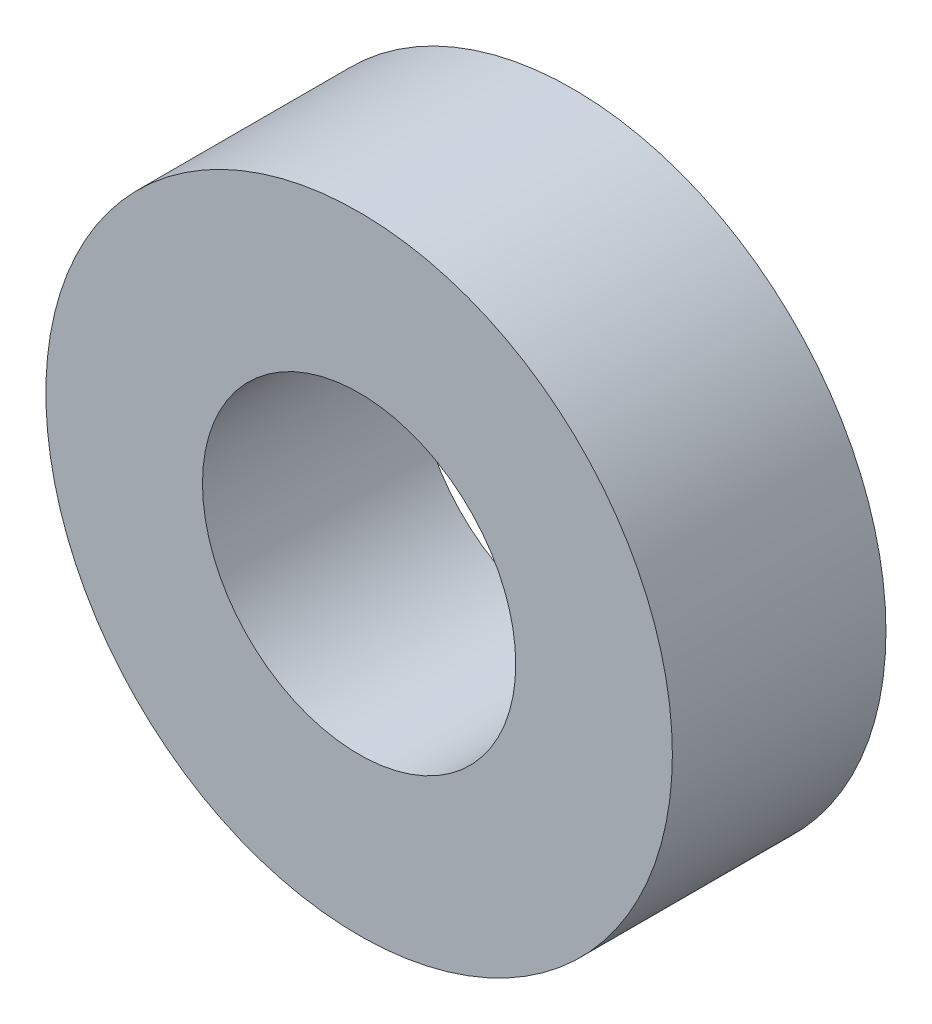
ISO-10303-21;
HEADER;
FILE_DESCRIPTION(('STEP AP214'),'2;1');
FILE_NAME('part.step','',(''),(''),'','','');
FILE_SCHEMA(('AUTOMOTIVE_DESIGN { 1 0 10303 214 1 1 1 1 }'));
ENDSEC;
DATA;
#1=APPLICATION_CONTEXT('core data for automotive mechanical design processes');
#2=APPLICATION_PROTOCOL_DEFINITION('international standard','automotive_design',2000,#1);
#3=PRODUCT_CONTEXT('',#1,'mechanical');
#4=PRODUCT('Part','Part','',(#3));
#5=PRODUCT_RELATED_PRODUCT_CATEGORY('part','',(#4));
#6=PRODUCT_DEFINITION_FORMATION('','',#4);
#7=PRODUCT_DEFINITION_CONTEXT('part definition',#1,'design');
#8=PRODUCT_DEFINITION('design','',#6,#7);
#9=PRODUCT_DEFINITION_SHAPE('','',#8);
#10=(LENGTH_UNIT() NAMED_UNIT(*) SI_UNIT(.MILLI.,.METRE.));
#11=(NAMED_UNIT(*) PLANE_ANGLE_UNIT() SI_UNIT($,.RADIAN.));
#12=(NAMED_UNIT(*) SI_UNIT($,.STERADIAN.) SOLID_ANGLE_UNIT());
#13=UNCERTAINTY_MEASURE_WITH_UNIT(LENGTH_MEASURE(1.E-05),#10,'distance_accuracy_value','');
#14=(GEOMETRIC_REPRESENTATION_CONTEXT(3) GLOBAL_UNCERTAINTY_ASSIGNED_CONTEXT((#13)) GLOBAL_UNIT_ASSIGNED_CONTEXT((#10,
#11,#12)) REPRESENTATION_CONTEXT('',''));
#15=CARTESIAN_POINT('',(0.,0.,0.));
#16=DIRECTION('',(0.,0.,1.));
#17=DIRECTION('',(1.,0.,0.));
#18=AXIS2_PLACEMENT_3D('',#15,#16,#17);
#19=CARTESIAN_POINT('',(0.,0.,95.25));
#20=DIRECTION('',(0.,0.,1.));
#21=DIRECTION('',(1.,0.,0.));
#22=AXIS2_PLACEMENT_3D('',#19,#20,#21);
#23=PLANE('',#22);
#24=CARTESIAN_POINT('',(0.,0.,95.25));
#25=DIRECTION('',(0.,0.,1.));
#26=DIRECTION('',(1.,0.,0.));
#27=AXIS2_PLACEMENT_3D('',#24,#25,#26);
#28=CIRCLE('',#27,139.7);
#29=CARTESIAN_POINT('',(139.7,0.,95.25));
#30=VERTEX_POINT('',#29);
#31=EDGE_CURVE('E10',#30,#30,#28,.T.);
#32=ORIENTED_EDGE('',*,*,#31,.T.);
#33=EDGE_LOOP('',(#32));
#34=FACE_BOUND('',#33,.T.);
#35=CARTESIAN_POINT('',(0.,0.,95.25));
#36=DIRECTION('',(0.,0.,1.));
#37=DIRECTION('',(1.,0.,0.));
#38=AXIS2_PLACEMENT_3D('',#35,#36,#37);
#39=CIRCLE('',#38,69.85);
#40=CARTESIAN_POINT('',(69.85,0.,95.25));
#41=VERTEX_POINT('',#40);
#42=EDGE_CURVE('E42',#41,#41,#39,.T.);
#43=ORIENTED_EDGE('',*,*,#42,.F.);
#44=EDGE_LOOP('',(#43));
#45=FACE_BOUND('',#44,.T.);
#46=ADVANCED_FACE('F31',(#34,#45),#23,.T.);
#47=CARTESIAN_POINT('',(0.,0.,0.));
#48=DIRECTION('',(0.,0.,1.));
#49=DIRECTION('',(1.,0.,0.));
#50=AXIS2_PLACEMENT_3D('',#47,#48,#49);
#51=PLANE('',#50);
#52=CARTESIAN_POINT('',(0.,0.,0.));
#53=DIRECTION('',(0.,0.,1.));
#54=DIRECTION('',(1.,0.,0.));
#55=AXIS2_PLACEMENT_3D('',#52,#53,#54);
#56=CIRCLE('',#55,139.7);
#57=CARTESIAN_POINT('',(139.7,0.,0.));
#58=VERTEX_POINT('',#57);
#59=EDGE_CURVE('E35',#58,#58,#56,.T.);
#60=ORIENTED_EDGE('',*,*,#59,.F.);
#61=EDGE_LOOP('',(#60));
#62=FACE_BOUND('',#61,.T.);
#63=CARTESIAN_POINT('',(0.,0.,0.));
#64=DIRECTION('',(0.,0.,1.));
#65=DIRECTION('',(1.,0.,0.));
#66=AXIS2_PLACEMENT_3D('',#63,#64,#65);
#67=CIRCLE('',#66,69.85);
#68=CARTESIAN_POINT('',(69.85,0.,0.));
#69=VERTEX_POINT('',#68);
#70=EDGE_CURVE('E44',#69,#69,#67,.T.);
#71=ORIENTED_EDGE('',*,*,#70,.T.);
#72=EDGE_LOOP('',(#71));
#73=FACE_BOUND('',#72,.T.);
#74=ADVANCED_FACE('F54',(#62,#73),#51,.F.);
#75=CARTESIAN_POINT('',(0.,0.,95.25));
#76=DIRECTION('',(0.,0.,-1.));
#77=DIRECTION('',(-1.,0.,0.));
#78=AXIS2_PLACEMENT_3D('',#75,#76,#77);
#79=CYLINDRICAL_SURFACE('',#78,139.7);
#80=ORIENTED_EDGE('',*,*,#31,.F.);
#81=EDGE_LOOP('',(#80));
#82=FACE_BOUND('',#81,.T.);
#83=ORIENTED_EDGE('',*,*,#59,.T.);
#84=EDGE_LOOP('',(#83));
#85=FACE_BOUND('',#84,.T.);
#86=ADVANCED_FACE('F33',(#82,#85),#79,.T.);
#87=CARTESIAN_POINT('',(0.,0.,95.25));
#88=DIRECTION('',(0.,0.,-1.));
#89=DIRECTION('',(-1.,0.,0.));
#90=AXIS2_PLACEMENT_3D('',#87,#88,#89);
#91=CYLINDRICAL_SURFACE('',#90,69.85);
#92=ORIENTED_EDGE('',*,*,#42,.T.);
#93=EDGE_LOOP('',(#92));
#94=FACE_BOUND('',#93,.T.);
#95=ORIENTED_EDGE('',*,*,#70,.F.);
#96=EDGE_LOOP('',(#95));
#97=FACE_BOUND('',#96,.T.);
#98=ADVANCED_FACE('F50',(#94,#97),#91,.F.);
#99=CLOSED_SHELL('',(#46,#74,#86,#98));
#100=MANIFOLD_SOLID_BREP('B2',#99);
#101=ADVANCED_BREP_SHAPE_REPRESENTATION('',(#18,#100),#14);
#102=SHAPE_DEFINITION_REPRESENTATION(#9,#101);
ENDSEC;
END-ISO-10303-21;
